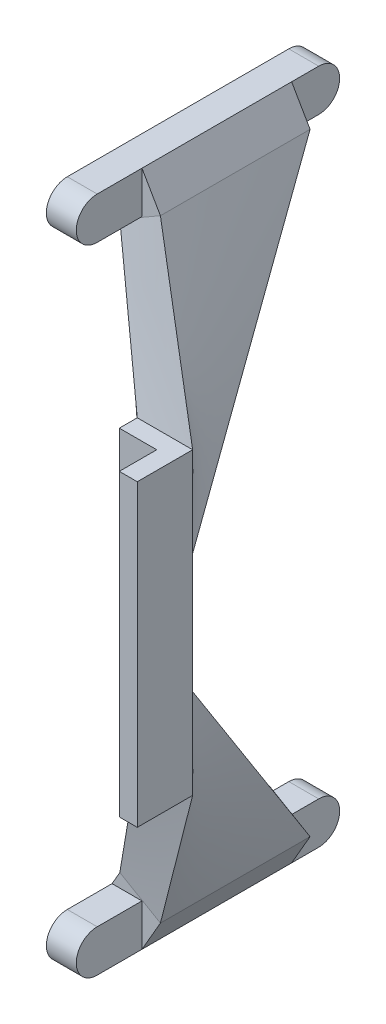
ISO-10303-21;
HEADER;
FILE_DESCRIPTION(('STEP AP214'),'2;1');
FILE_NAME('part.step','',(''),(''),'','','');
FILE_SCHEMA(('AUTOMOTIVE_DESIGN { 1 0 10303 214 1 1 1 1 }'));
ENDSEC;
DATA;
#1=APPLICATION_CONTEXT('core data for automotive mechanical design processes');
#2=APPLICATION_PROTOCOL_DEFINITION('international standard','automotive_design',2000,#1);
#3=PRODUCT_CONTEXT('',#1,'mechanical');
#4=PRODUCT('Part','Part','',(#3));
#5=PRODUCT_RELATED_PRODUCT_CATEGORY('part','',(#4));
#6=PRODUCT_DEFINITION_FORMATION('','',#4);
#7=PRODUCT_DEFINITION_CONTEXT('part definition',#1,'design');
#8=PRODUCT_DEFINITION('design','',#6,#7);
#9=PRODUCT_DEFINITION_SHAPE('','',#8);
#10=(LENGTH_UNIT() NAMED_UNIT(*) SI_UNIT(.MILLI.,.METRE.));
#11=(NAMED_UNIT(*) PLANE_ANGLE_UNIT() SI_UNIT($,.RADIAN.));
#12=(NAMED_UNIT(*) SI_UNIT($,.STERADIAN.) SOLID_ANGLE_UNIT());
#13=UNCERTAINTY_MEASURE_WITH_UNIT(LENGTH_MEASURE(1.E-05),#10,'distance_accuracy_value','');
#14=(GEOMETRIC_REPRESENTATION_CONTEXT(3) GLOBAL_UNCERTAINTY_ASSIGNED_CONTEXT((#13)) GLOBAL_UNIT_ASSIGNED_CONTEXT((#10,
#11,#12)) REPRESENTATION_CONTEXT('',''));
#15=CARTESIAN_POINT('',(0.,0.,0.));
#16=DIRECTION('',(0.,0.,1.));
#17=DIRECTION('',(1.,0.,0.));
#18=AXIS2_PLACEMENT_3D('',#15,#16,#17);
#19=CARTESIAN_POINT('',(-13.2905499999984,-70.5074559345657,-0.666749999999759));
#20=DIRECTION('',(-1.,0.,0.));
#21=DIRECTION('',(0.,0.,1.));
#22=AXIS2_PLACEMENT_3D('',#19,#20,#21);
#23=CYLINDRICAL_SURFACE('',#22,4.445);
#24=CARTESIAN_POINT('',(-19.6405499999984,-70.5074559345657,-0.666749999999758));
#25=DIRECTION('',(1.,0.,0.));
#26=DIRECTION('',(0.,0.,-1.));
#27=AXIS2_PLACEMENT_3D('',#24,#25,#26);
#28=CIRCLE('',#27,4.445);
#29=CARTESIAN_POINT('',(-19.6405499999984,-66.0624559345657,-0.666749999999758));
#30=VERTEX_POINT('',#29);
#31=CARTESIAN_POINT('',(-19.6405499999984,-74.9524559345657,-0.666749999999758));
#32=VERTEX_POINT('',#31);
#33=EDGE_CURVE('E146',#30,#32,#28,.T.);
#34=ORIENTED_EDGE('',*,*,#33,.T.);
#35=DIRECTION('',(-1.,0.,0.));
#36=VECTOR('',#35,1.);
#37=CARTESIAN_POINT('',(-13.2905499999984,-74.9524559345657,-0.666749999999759));
#38=LINE('',#37,#36);
#39=CARTESIAN_POINT('',(-13.2905499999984,-74.9524559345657,-0.666749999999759));
#40=VERTEX_POINT('',#39);
#41=EDGE_CURVE('E13',#40,#32,#38,.T.);
#42=ORIENTED_EDGE('',*,*,#41,.F.);
#43=CARTESIAN_POINT('',(-13.2905499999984,-70.5074559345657,-0.666749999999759));
#44=DIRECTION('',(1.,0.,0.));
#45=DIRECTION('',(0.,0.,-1.));
#46=AXIS2_PLACEMENT_3D('',#43,#44,#45);
#47=CIRCLE('',#46,4.445);
#48=CARTESIAN_POINT('',(-13.2905499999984,-66.0624559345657,-0.666749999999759));
#49=VERTEX_POINT('',#48);
#50=EDGE_CURVE('E129',#49,#40,#47,.T.);
#51=ORIENTED_EDGE('',*,*,#50,.F.);
#52=DIRECTION('',(-1.,0.,0.));
#53=VECTOR('',#52,1.);
#54=CARTESIAN_POINT('',(-13.2905499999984,-66.0624559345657,-0.666749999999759));
#55=LINE('',#54,#53);
#56=EDGE_CURVE('E142',#49,#30,#55,.T.);
#57=ORIENTED_EDGE('',*,*,#56,.T.);
#58=EDGE_LOOP('',(#34,#42,#51,#57));
#59=FACE_BOUND('',#58,.T.);
#60=ADVANCED_FACE('F71',(#59),#23,.T.);
#61=CARTESIAN_POINT('',(-13.2905499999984,-74.9524559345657,-0.666749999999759));
#62=DIRECTION('',(0.,1.,0.));
#63=DIRECTION('',(0.,0.,1.));
#64=AXIS2_PLACEMENT_3D('',#61,#62,#63);
#65=PLANE('',#64);
#66=DIRECTION('',(0.,0.,-1.));
#67=VECTOR('',#66,1.);
#68=CARTESIAN_POINT('',(-19.6405499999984,-74.9524559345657,-0.666749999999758));
#69=LINE('',#68,#67);
#70=CARTESIAN_POINT('',(-19.6405499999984,-74.9524559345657,-47.6567499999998));
#71=VERTEX_POINT('',#70);
#72=EDGE_CURVE('E134',#32,#71,#69,.T.);
#73=ORIENTED_EDGE('',*,*,#72,.T.);
#74=DIRECTION('',(-1.,0.,0.));
#75=VECTOR('',#74,1.);
#76=CARTESIAN_POINT('',(-13.2905499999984,-74.9524559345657,-47.6567499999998));
#77=LINE('',#76,#75);
#78=CARTESIAN_POINT('',(-13.2905499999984,-74.9524559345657,-47.6567499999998));
#79=VERTEX_POINT('',#78);
#80=EDGE_CURVE('E80',#79,#71,#77,.T.);
#81=ORIENTED_EDGE('',*,*,#80,.F.);
#82=DIRECTION('',(0.,0.,-1.));
#83=VECTOR('',#82,1.);
#84=CARTESIAN_POINT('',(-13.2905499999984,-74.9524559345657,-0.666749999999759));
#85=LINE('',#84,#83);
#86=EDGE_CURVE('E123',#40,#79,#85,.T.);
#87=ORIENTED_EDGE('',*,*,#86,.F.);
#88=ORIENTED_EDGE('',*,*,#41,.T.);
#89=EDGE_LOOP('',(#73,#81,#87,#88));
#90=FACE_BOUND('',#89,.T.);
#91=ADVANCED_FACE('F133',(#90),#65,.F.);
#92=CARTESIAN_POINT('',(-13.2905499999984,-70.5074559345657,-47.6567499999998));
#93=DIRECTION('',(-1.,0.,0.));
#94=DIRECTION('',(0.,0.,1.));
#95=AXIS2_PLACEMENT_3D('',#92,#93,#94);
#96=CYLINDRICAL_SURFACE('',#95,4.44500000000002);
#97=CARTESIAN_POINT('',(-19.6405499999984,-70.5074559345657,-47.6567499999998));
#98=DIRECTION('',(1.,0.,0.));
#99=DIRECTION('',(0.,0.,-1.));
#100=AXIS2_PLACEMENT_3D('',#97,#98,#99);
#101=CIRCLE('',#100,4.44500000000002);
#102=CARTESIAN_POINT('',(-19.6405499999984,-66.0624559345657,-47.6567499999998));
#103=VERTEX_POINT('',#102);
#104=EDGE_CURVE('E110',#71,#103,#101,.T.);
#105=ORIENTED_EDGE('',*,*,#104,.T.);
#106=DIRECTION('',(-1.,0.,0.));
#107=VECTOR('',#106,1.);
#108=CARTESIAN_POINT('',(-13.2905499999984,-66.0624559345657,-47.6567499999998));
#109=LINE('',#108,#107);
#110=CARTESIAN_POINT('',(-13.2905499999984,-66.0624559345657,-47.6567499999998));
#111=VERTEX_POINT('',#110);
#112=EDGE_CURVE('E136',#111,#103,#109,.T.);
#113=ORIENTED_EDGE('',*,*,#112,.F.);
#114=CARTESIAN_POINT('',(-13.2905499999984,-70.5074559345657,-47.6567499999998));
#115=DIRECTION('',(1.,0.,0.));
#116=DIRECTION('',(0.,0.,-1.));
#117=AXIS2_PLACEMENT_3D('',#114,#115,#116);
#118=CIRCLE('',#117,4.44500000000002);
#119=EDGE_CURVE('E127',#79,#111,#118,.T.);
#120=ORIENTED_EDGE('',*,*,#119,.F.);
#121=ORIENTED_EDGE('',*,*,#80,.T.);
#122=EDGE_LOOP('',(#105,#113,#120,#121));
#123=FACE_BOUND('',#122,.T.);
#124=ADVANCED_FACE('F137',(#123),#96,.T.);
#125=CARTESIAN_POINT('',(-13.2905499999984,-66.0624559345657,-0.666749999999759));
#126=DIRECTION('',(0.,-1.,0.));
#127=DIRECTION('',(0.,0.,-1.));
#128=AXIS2_PLACEMENT_3D('',#125,#126,#127);
#129=PLANE('',#128);
#130=DIRECTION('',(0.,0.,1.));
#131=VECTOR('',#130,1.);
#132=CARTESIAN_POINT('',(-19.6405499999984,-66.0624559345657,-0.666749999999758));
#133=LINE('',#132,#131);
#134=EDGE_CURVE('E116',#103,#30,#133,.T.);
#135=ORIENTED_EDGE('',*,*,#134,.T.);
#136=ORIENTED_EDGE('',*,*,#56,.F.);
#137=DIRECTION('',(0.,0.,1.));
#138=VECTOR('',#137,1.);
#139=CARTESIAN_POINT('',(-13.2905499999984,-66.0624559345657,-0.666749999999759));
#140=LINE('',#139,#138);
#141=EDGE_CURVE('E91',#111,#49,#140,.T.);
#142=ORIENTED_EDGE('',*,*,#141,.F.);
#143=ORIENTED_EDGE('',*,*,#112,.T.);
#144=EDGE_LOOP('',(#135,#136,#142,#143));
#145=FACE_BOUND('',#144,.T.);
#146=ADVANCED_FACE('F158',(#145),#129,.F.);
#147=CARTESIAN_POINT('',(-13.2905499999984,-70.5074559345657,-0.666749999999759));
#148=DIRECTION('',(1.,0.,0.));
#149=DIRECTION('',(0.,0.,-1.));
#150=AXIS2_PLACEMENT_3D('',#147,#148,#149);
#151=PLANE('',#150);
#152=ORIENTED_EDGE('',*,*,#50,.T.);
#153=ORIENTED_EDGE('',*,*,#86,.T.);
#154=ORIENTED_EDGE('',*,*,#119,.T.);
#155=ORIENTED_EDGE('',*,*,#141,.T.);
#156=EDGE_LOOP('',(#152,#153,#154,#155));
#157=FACE_BOUND('',#156,.T.);
#158=ADVANCED_FACE('F125',(#157),#151,.T.);
#159=CARTESIAN_POINT('',(-19.6405499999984,-70.5074559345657,-0.666749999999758));
#160=DIRECTION('',(1.,0.,0.));
#161=DIRECTION('',(0.,0.,-1.));
#162=AXIS2_PLACEMENT_3D('',#159,#160,#161);
#163=PLANE('',#162);
#164=ORIENTED_EDGE('',*,*,#33,.F.);
#165=ORIENTED_EDGE('',*,*,#134,.F.);
#166=ORIENTED_EDGE('',*,*,#104,.F.);
#167=ORIENTED_EDGE('',*,*,#72,.F.);
#168=EDGE_LOOP('',(#164,#165,#166,#167));
#169=FACE_BOUND('',#168,.T.);
#170=ADVANCED_FACE('F161',(#169),#163,.F.);
#171=CLOSED_SHELL('',(#60,#91,#124,#146,#158,#170));
#172=MANIFOLD_SOLID_BREP('B2',#171);
#173=CARTESIAN_POINT('',(3.81,-34.9474559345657,-3.80999999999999));
#174=DIRECTION('',(0.,0.,-1.));
#175=DIRECTION('',(0.,1.,0.));
#176=AXIS2_PLACEMENT_3D('',#173,#174,#175);
#177=PLANE('',#176);
#178=DIRECTION('',(1.,0.,0.));
#179=VECTOR('',#178,1.);
#180=CARTESIAN_POINT('',(-7.9375,-15.8974559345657,-3.81));
#181=LINE('',#180,#179);
#182=CARTESIAN_POINT('',(-7.9375,-15.8974559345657,-3.80999999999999));
#183=VERTEX_POINT('',#182);
#184=CARTESIAN_POINT('',(3.81,-15.8974559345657,-3.81));
#185=VERTEX_POINT('',#184);
#186=EDGE_CURVE('E240',#183,#185,#181,.T.);
#187=ORIENTED_EDGE('',*,*,#186,.F.);
#188=DIRECTION('',(0.,1.,0.));
#189=VECTOR('',#188,1.);
#190=CARTESIAN_POINT('',(-7.9375,-34.9474559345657,-3.80999999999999));
#191=LINE('',#190,#189);
#192=CARTESIAN_POINT('',(-7.9375,9.50254406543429,-3.81));
#193=VERTEX_POINT('',#192);
#194=EDGE_CURVE('E617',#183,#193,#191,.T.);
#195=ORIENTED_EDGE('',*,*,#194,.T.);
#196=DIRECTION('',(1.,0.,0.));
#197=VECTOR('',#196,1.);
#198=CARTESIAN_POINT('',(-7.9375,9.50254406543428,-3.81));
#199=LINE('',#198,#197);
#200=CARTESIAN_POINT('',(3.81,9.50254406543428,-3.81));
#201=VERTEX_POINT('',#200);
#202=EDGE_CURVE('E663',#193,#201,#199,.T.);
#203=ORIENTED_EDGE('',*,*,#202,.T.);
#204=DIRECTION('',(0.,1.,0.));
#205=VECTOR('',#204,1.);
#206=CARTESIAN_POINT('',(3.81,-34.9474559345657,-3.80999999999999));
#207=LINE('',#206,#205);
#208=EDGE_CURVE('E246',#185,#201,#207,.T.);
#209=ORIENTED_EDGE('',*,*,#208,.F.);
#210=EDGE_LOOP('',(#187,#195,#203,#209));
#211=FACE_BOUND('',#210,.T.);
#212=ADVANCED_FACE('F218',(#211),#177,.T.);
#213=CARTESIAN_POINT('',(0.,-34.9474559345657,0.));
#214=DIRECTION('',(-1.,0.,0.));
#215=DIRECTION('',(0.,0.,1.));
#216=AXIS2_PLACEMENT_3D('',#213,#214,#215);
#217=PLANE('',#216);
#218=DIRECTION('',(0.,0.,1.));
#219=VECTOR('',#218,1.);
#220=CARTESIAN_POINT('',(0.,28.5525440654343,0.));
#221=LINE('',#220,#219);
#222=CARTESIAN_POINT('',(0.,28.5525440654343,0.));
#223=VERTEX_POINT('',#222);
#224=CARTESIAN_POINT('',(0.,28.5525440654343,7.93749999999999));
#225=VERTEX_POINT('',#224);
#226=EDGE_CURVE('E674',#223,#225,#221,.T.);
#227=ORIENTED_EDGE('',*,*,#226,.F.);
#228=DIRECTION('',(0.,1.,0.));
#229=VECTOR('',#228,1.);
#230=CARTESIAN_POINT('',(0.,-34.9474559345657,0.));
#231=LINE('',#230,#229);
#232=CARTESIAN_POINT('',(0.,-34.9474559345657,0.));
#233=VERTEX_POINT('',#232);
#234=EDGE_CURVE('E69',#233,#223,#231,.T.);
#235=ORIENTED_EDGE('',*,*,#234,.F.);
#236=DIRECTION('',(0.,0.,1.));
#237=VECTOR('',#236,1.);
#238=CARTESIAN_POINT('',(0.,-34.9474559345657,0.));
#239=LINE('',#238,#237);
#240=CARTESIAN_POINT('',(0.,-34.9474559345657,7.93750000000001));
#241=VERTEX_POINT('',#240);
#242=EDGE_CURVE('E715',#233,#241,#239,.T.);
#243=ORIENTED_EDGE('',*,*,#242,.T.);
#244=DIRECTION('',(0.,1.,0.));
#245=VECTOR('',#244,1.);
#246=CARTESIAN_POINT('',(0.,-34.9474559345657,7.93750000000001));
#247=LINE('',#246,#245);
#248=EDGE_CURVE('E636',#241,#225,#247,.T.);
#249=ORIENTED_EDGE('',*,*,#248,.T.);
#250=EDGE_LOOP('',(#227,#235,#243,#249));
#251=FACE_BOUND('',#250,.T.);
#252=ADVANCED_FACE('F220',(#251),#217,.T.);
#253=CARTESIAN_POINT('',(0.,-34.9474559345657,0.));
#254=DIRECTION('',(0.,0.,1.));
#255=DIRECTION('',(0.,-1.,0.));
#256=AXIS2_PLACEMENT_3D('',#253,#254,#255);
#257=PLANE('',#256);
#258=DIRECTION('',(1.,0.,0.));
#259=VECTOR('',#258,1.);
#260=CARTESIAN_POINT('',(0.,28.5525440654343,0.));
#261=LINE('',#260,#259);
#262=CARTESIAN_POINT('',(-7.9375,28.5525440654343,0.));
#263=VERTEX_POINT('',#262);
#264=EDGE_CURVE('E644',#263,#223,#261,.T.);
#265=ORIENTED_EDGE('',*,*,#264,.F.);
#266=DIRECTION('',(0.,1.,0.));
#267=VECTOR('',#266,1.);
#268=CARTESIAN_POINT('',(-7.9375,-34.9474559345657,0.));
#269=LINE('',#268,#267);
#270=CARTESIAN_POINT('',(-7.9375,-34.9474559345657,0.));
#271=VERTEX_POINT('',#270);
#272=EDGE_CURVE('E229',#271,#263,#269,.T.);
#273=ORIENTED_EDGE('',*,*,#272,.F.);
#274=DIRECTION('',(1.,0.,0.));
#275=VECTOR('',#274,1.);
#276=CARTESIAN_POINT('',(0.,-34.9474559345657,0.));
#277=LINE('',#276,#275);
#278=EDGE_CURVE('E639',#271,#233,#277,.T.);
#279=ORIENTED_EDGE('',*,*,#278,.T.);
#280=ORIENTED_EDGE('',*,*,#234,.T.);
#281=EDGE_LOOP('',(#265,#273,#279,#280));
#282=FACE_BOUND('',#281,.T.);
#283=ADVANCED_FACE('F741',(#282),#257,.T.);
#284=CARTESIAN_POINT('',(-7.9375,-34.9474559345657,-3.80999999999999));
#285=DIRECTION('',(-1.,0.,0.));
#286=DIRECTION('',(0.,-1.,0.));
#287=AXIS2_PLACEMENT_3D('',#284,#285,#286);
#288=PLANE('',#287);
#289=DIRECTION('',(0.,0.,1.));
#290=VECTOR('',#289,1.);
#291=CARTESIAN_POINT('',(-7.9375,28.5525440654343,-3.81000000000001));
#292=LINE('',#291,#290);
#293=CARTESIAN_POINT('',(-7.9375,28.5525440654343,-3.81));
#294=VERTEX_POINT('',#293);
#295=EDGE_CURVE('E640',#294,#263,#292,.T.);
#296=ORIENTED_EDGE('',*,*,#295,.F.);
#297=DIRECTION('',(0.,-1.,0.));
#298=VECTOR('',#297,1.);
#299=CARTESIAN_POINT('',(-7.9375,28.5525440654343,-3.81));
#300=LINE('',#299,#298);
#301=EDGE_CURVE('E659',#294,#193,#300,.T.);
#302=ORIENTED_EDGE('',*,*,#301,.T.);
#303=ORIENTED_EDGE('',*,*,#194,.F.);
#304=CARTESIAN_POINT('',(-7.9375,-34.9474559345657,-3.81));
#305=CARTESIAN_POINT('',(-7.9375,-31.7724559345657,-3.81));
#306=CARTESIAN_POINT('',(-7.9375,-28.5974559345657,-3.81));
#307=CARTESIAN_POINT('',(-7.9375,-22.2474559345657,-3.81));
#308=CARTESIAN_POINT('',(-7.9375,-19.0724559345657,-3.81));
#309=CARTESIAN_POINT('',(-7.9375,-15.8974559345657,-3.81));
#310=B_SPLINE_CURVE_WITH_KNOTS('',3,(#304,#305,#306,#307,#308,#309),.UNSPECIFIED.,.F.,.F.,(4,2,
4),(0.,0.5,1.),.UNSPECIFIED.);
#311=CARTESIAN_POINT('',(-7.9375,-34.9474559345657,-3.81));
#312=VERTEX_POINT('',#311);
#313=EDGE_CURVE('E604',#312,#183,#310,.T.);
#314=ORIENTED_EDGE('',*,*,#313,.F.);
#315=DIRECTION('',(0.,0.,1.));
#316=VECTOR('',#315,1.);
#317=CARTESIAN_POINT('',(-7.9375,-34.9474559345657,-3.80999999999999));
#318=LINE('',#317,#316);
#319=EDGE_CURVE('E727',#312,#271,#318,.T.);
#320=ORIENTED_EDGE('',*,*,#319,.T.);
#321=ORIENTED_EDGE('',*,*,#272,.T.);
#322=EDGE_LOOP('',(#296,#302,#303,#314,#320,#321));
#323=FACE_BOUND('',#322,.T.);
#324=ADVANCED_FACE('F779',(#323),#288,.T.);
#325=CARTESIAN_POINT('',(3.81,-34.9474559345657,7.93750000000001));
#326=DIRECTION('',(1.,0.,0.));
#327=DIRECTION('',(0.,1.,0.));
#328=AXIS2_PLACEMENT_3D('',#325,#326,#327);
#329=PLANE('',#328);
#330=DIRECTION('',(0.,0.,-1.));
#331=VECTOR('',#330,1.);
#332=CARTESIAN_POINT('',(3.81,28.5525440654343,7.93749999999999));
#333=LINE('',#332,#331);
#334=CARTESIAN_POINT('',(3.81,28.5525440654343,7.93749999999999));
#335=VERTEX_POINT('',#334);
#336=CARTESIAN_POINT('',(3.81,28.5525440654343,-3.81));
#337=VERTEX_POINT('',#336);
#338=EDGE_CURVE('E648',#335,#337,#333,.T.);
#339=ORIENTED_EDGE('',*,*,#338,.F.);
#340=DIRECTION('',(0.,1.,0.));
#341=VECTOR('',#340,1.);
#342=CARTESIAN_POINT('',(3.81,-34.9474559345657,7.93750000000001));
#343=LINE('',#342,#341);
#344=CARTESIAN_POINT('',(3.81,-34.9474559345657,7.93750000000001));
#345=VERTEX_POINT('',#344);
#346=EDGE_CURVE('E633',#345,#335,#343,.T.);
#347=ORIENTED_EDGE('',*,*,#346,.F.);
#348=DIRECTION('',(0.,0.,-1.));
#349=VECTOR('',#348,1.);
#350=CARTESIAN_POINT('',(3.81,-34.9474559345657,7.93750000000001));
#351=LINE('',#350,#349);
#352=CARTESIAN_POINT('',(3.81,-34.9474559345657,-3.80999999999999));
#353=VERTEX_POINT('',#352);
#354=EDGE_CURVE('E723',#345,#353,#351,.T.);
#355=ORIENTED_EDGE('',*,*,#354,.T.);
#356=CARTESIAN_POINT('',(3.81,-15.8974559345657,-3.81));
#357=CARTESIAN_POINT('',(3.81,-19.0724559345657,-3.81));
#358=CARTESIAN_POINT('',(3.81,-22.2474559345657,-3.81));
#359=CARTESIAN_POINT('',(3.81,-28.5974559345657,-3.81));
#360=CARTESIAN_POINT('',(3.81,-31.7724559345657,-3.81));
#361=CARTESIAN_POINT('',(3.81,-34.9474559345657,-3.81));
#362=B_SPLINE_CURVE_WITH_KNOTS('',3,(#356,#357,#358,#359,#360,#361),.UNSPECIFIED.,.F.,.F.,(4,2,
4),(0.,0.5,1.),.UNSPECIFIED.);
#363=EDGE_CURVE('E507',#353,#185,#362,.F.);
#364=ORIENTED_EDGE('',*,*,#363,.T.);
#365=ORIENTED_EDGE('',*,*,#208,.T.);
#366=DIRECTION('',(0.,1.,0.));
#367=VECTOR('',#366,1.);
#368=CARTESIAN_POINT('',(3.81,28.5525440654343,-3.81));
#369=LINE('',#368,#367);
#370=EDGE_CURVE('E669',#201,#337,#369,.T.);
#371=ORIENTED_EDGE('',*,*,#370,.T.);
#372=EDGE_LOOP('',(#339,#347,#355,#364,#365,#371));
#373=FACE_BOUND('',#372,.T.);
#374=ADVANCED_FACE('F752',(#373),#329,.T.);
#375=CARTESIAN_POINT('',(0.,-34.9474559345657,7.93750000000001));
#376=DIRECTION('',(0.,0.,1.));
#377=DIRECTION('',(0.,-1.,0.));
#378=AXIS2_PLACEMENT_3D('',#375,#376,#377);
#379=PLANE('',#378);
#380=DIRECTION('',(1.,0.,0.));
#381=VECTOR('',#380,1.);
#382=CARTESIAN_POINT('',(0.,28.5525440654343,7.93749999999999));
#383=LINE('',#382,#381);
#384=EDGE_CURVE('E651',#225,#335,#383,.T.);
#385=ORIENTED_EDGE('',*,*,#384,.F.);
#386=ORIENTED_EDGE('',*,*,#248,.F.);
#387=DIRECTION('',(1.,0.,0.));
#388=VECTOR('',#387,1.);
#389=CARTESIAN_POINT('',(0.,-34.9474559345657,7.93750000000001));
#390=LINE('',#389,#388);
#391=EDGE_CURVE('E719',#241,#345,#390,.T.);
#392=ORIENTED_EDGE('',*,*,#391,.T.);
#393=ORIENTED_EDGE('',*,*,#346,.T.);
#394=EDGE_LOOP('',(#385,#386,#392,#393));
#395=FACE_BOUND('',#394,.T.);
#396=ADVANCED_FACE('F748',(#395),#379,.T.);
#397=CARTESIAN_POINT('',(0.,-34.9474559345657,0.));
#398=DIRECTION('',(0.,1.,0.));
#399=DIRECTION('',(0.,0.,1.));
#400=AXIS2_PLACEMENT_3D('',#397,#398,#399);
#401=PLANE('',#400);
#402=ORIENTED_EDGE('',*,*,#242,.F.);
#403=ORIENTED_EDGE('',*,*,#278,.F.);
#404=ORIENTED_EDGE('',*,*,#319,.F.);
#405=DIRECTION('',(1.,0.,0.));
#406=VECTOR('',#405,1.);
#407=CARTESIAN_POINT('',(0.,-34.9474559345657,-3.80999999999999));
#408=LINE('',#407,#406);
#409=EDGE_CURVE('E782',#353,#312,#408,.F.);
#410=ORIENTED_EDGE('',*,*,#409,.F.);
#411=ORIENTED_EDGE('',*,*,#354,.F.);
#412=ORIENTED_EDGE('',*,*,#391,.F.);
#413=EDGE_LOOP('',(#402,#403,#404,#410,#411,#412));
#414=FACE_BOUND('',#413,.T.);
#415=ADVANCED_FACE('F784',(#414),#401,.F.);
#416=CARTESIAN_POINT('',(0.,28.5525440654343,0.));
#417=DIRECTION('',(0.,1.,0.));
#418=DIRECTION('',(0.,0.,1.));
#419=AXIS2_PLACEMENT_3D('',#416,#417,#418);
#420=PLANE('',#419);
#421=ORIENTED_EDGE('',*,*,#226,.T.);
#422=ORIENTED_EDGE('',*,*,#384,.T.);
#423=ORIENTED_EDGE('',*,*,#338,.T.);
#424=DIRECTION('',(1.,0.,0.));
#425=VECTOR('',#424,1.);
#426=CARTESIAN_POINT('',(0.,28.5525440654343,-3.81000000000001));
#427=LINE('',#426,#425);
#428=EDGE_CURVE('E645',#337,#294,#427,.F.);
#429=ORIENTED_EDGE('',*,*,#428,.T.);
#430=ORIENTED_EDGE('',*,*,#295,.T.);
#431=ORIENTED_EDGE('',*,*,#264,.T.);
#432=EDGE_LOOP('',(#421,#422,#423,#429,#430,#431));
#433=FACE_BOUND('',#432,.T.);
#434=ADVANCED_FACE('F737',(#433),#420,.T.);
#435=CARTESIAN_POINT('',(-9.37756708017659,61.7800588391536,-10.16));
#436=CARTESIAN_POINT('',(3.81,28.5525440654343,-3.81));
#437=CARTESIAN_POINT('',(-10.8128975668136,60.9513703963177,-10.16));
#438=CARTESIAN_POINT('',(1.85208333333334,28.5525440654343,-3.81));
#439=CARTESIAN_POINT('',(-12.2482280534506,60.1226819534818,-10.16));
#440=CARTESIAN_POINT('',(-0.105833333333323,28.5525440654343,-3.81));
#441=CARTESIAN_POINT('',(-15.1188890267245,58.4653050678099,-10.16));
#442=CARTESIAN_POINT('',(-4.02166666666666,28.5525440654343,-3.81));
#443=CARTESIAN_POINT('',(-16.5542195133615,57.636616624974,-10.16));
#444=CARTESIAN_POINT('',(-5.97958333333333,28.5525440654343,-3.81));
#445=CARTESIAN_POINT('',(-17.9895499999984,56.8079281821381,-10.16));
#446=CARTESIAN_POINT('',(-7.9375,28.5525440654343,-3.81));
#447=B_SPLINE_SURFACE_WITH_KNOTS('',3,1,((#435,#436),(#437,#438),(#439,#440),(#441,#442),(#443,
#444),(#445,#446)),.UNSPECIFIED.,.F.,.F.,.F.,(4,2,4),(2,2),(0.,0.5,1.),(0.,1.),.UNSPECIFIED.);
#448=DIRECTION('',(-0.866025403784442,-0.499999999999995,0.));
#449=VECTOR('',#448,1.);
#450=CARTESIAN_POINT('',(-9.37756708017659,61.7800588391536,-10.16));
#451=LINE('',#450,#449);
#452=CARTESIAN_POINT('',(-9.37756708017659,61.7800588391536,-10.16));
#453=VERTEX_POINT('',#452);
#454=CARTESIAN_POINT('',(-17.9895499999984,56.8079281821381,-10.16));
#455=VERTEX_POINT('',#454);
#456=EDGE_CURVE('E689',#453,#455,#451,.T.);
#457=DIRECTION('',(0.32790830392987,-0.921719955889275,0.207143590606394));
#458=VECTOR('',#457,1.);
#459=CARTESIAN_POINT('',(-12.9635249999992,42.6802361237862,-6.985));
#460=LINE('',#459,#458);
#461=EDGE_CURVE('E777',#455,#294,#460,.T.);
#462=DIRECTION('',(-0.363209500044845,0.915145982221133,-0.174890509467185));
#463=VECTOR('',#462,1.);
#464=CARTESIAN_POINT('',(-2.78378354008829,45.166301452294,-6.985));
#465=LINE('',#464,#463);
#466=EDGE_CURVE('E763',#337,#453,#465,.T.);
#467=ORIENTED_EDGE('',*,*,#456,.T.);
#468=ORIENTED_EDGE('',*,*,#461,.T.);
#469=ORIENTED_EDGE('',*,*,#428,.F.);
#470=ORIENTED_EDGE('',*,*,#466,.T.);
#471=EDGE_LOOP('',(#467,#468,#469,#470));
#472=FACE_BOUND('',#471,.T.);
#473=ADVANCED_FACE('F1000',(#472),#447,.T.);
#474=CARTESIAN_POINT('',(-17.9895499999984,56.8079281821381,-10.16));
#475=CARTESIAN_POINT('',(-7.9375,28.5525440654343,-3.81));
#476=CARTESIAN_POINT('',(-17.9895499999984,56.8079281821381,-15.4516666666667));
#477=CARTESIAN_POINT('',(-7.9375,25.3775440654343,-3.81));
#478=CARTESIAN_POINT('',(-17.9895499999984,56.8079281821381,-20.7433333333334));
#479=CARTESIAN_POINT('',(-7.9375,22.2025440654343,-3.81));
#480=CARTESIAN_POINT('',(-17.9895499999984,56.8079281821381,-31.3266666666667));
#481=CARTESIAN_POINT('',(-7.9375,15.8525440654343,-3.81));
#482=CARTESIAN_POINT('',(-17.9895499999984,56.8079281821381,-36.6183333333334));
#483=CARTESIAN_POINT('',(-7.9375,12.6775440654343,-3.81));
#484=CARTESIAN_POINT('',(-17.9895499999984,56.8079281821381,-41.91));
#485=CARTESIAN_POINT('',(-7.9375,9.50254406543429,-3.81));
#486=B_SPLINE_SURFACE_WITH_KNOTS('',3,1,((#474,#475),(#476,#477),(#478,#479),(#480,#481),(#482,
#483),(#484,#485)),.UNSPECIFIED.,.F.,.F.,.F.,(4,2,4),(2,2),(0.,0.5,1.),(0.,1.),.UNSPECIFIED.);
#487=DIRECTION('',(0.,0.,-1.));
#488=VECTOR('',#487,1.);
#489=CARTESIAN_POINT('',(-17.9895499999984,56.8079281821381,-41.91));
#490=LINE('',#489,#488);
#491=CARTESIAN_POINT('',(-17.9895499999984,56.8079281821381,-41.91));
#492=VERTEX_POINT('',#491);
#493=EDGE_CURVE('E707',#455,#492,#490,.T.);
#494=DIRECTION('',(0.163271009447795,-0.768360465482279,0.618841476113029));
#495=VECTOR('',#494,1.);
#496=CARTESIAN_POINT('',(-12.9635249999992,33.1552361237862,-22.86));
#497=LINE('',#496,#495);
#498=EDGE_CURVE('E768',#492,#193,#497,.T.);
#499=ORIENTED_EDGE('',*,*,#493,.T.);
#500=ORIENTED_EDGE('',*,*,#498,.T.);
#501=ORIENTED_EDGE('',*,*,#301,.F.);
#502=ORIENTED_EDGE('',*,*,#461,.F.);
#503=EDGE_LOOP('',(#499,#500,#501,#502));
#504=FACE_BOUND('',#503,.T.);
#505=ADVANCED_FACE('F771',(#504),#486,.T.);
#506=CARTESIAN_POINT('',(-9.37756708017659,61.7800588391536,-41.91));
#507=CARTESIAN_POINT('',(3.81,9.50254406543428,-3.81));
#508=CARTESIAN_POINT('',(-9.37756708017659,61.7800588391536,-36.6183333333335));
#509=CARTESIAN_POINT('',(3.81,12.6775440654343,-3.81));
#510=CARTESIAN_POINT('',(-9.37756708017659,61.7800588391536,-31.3266666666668));
#511=CARTESIAN_POINT('',(3.81,15.8525440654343,-3.81));
#512=CARTESIAN_POINT('',(-9.37756708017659,61.7800588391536,-20.7433333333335));
#513=CARTESIAN_POINT('',(3.81,22.2025440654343,-3.81));
#514=CARTESIAN_POINT('',(-9.37756708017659,61.7800588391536,-15.4516666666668));
#515=CARTESIAN_POINT('',(3.81,25.3775440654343,-3.81));
#516=CARTESIAN_POINT('',(-9.37756708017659,61.7800588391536,-10.16));
#517=CARTESIAN_POINT('',(3.81,28.5525440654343,-3.81));
#518=B_SPLINE_SURFACE_WITH_KNOTS('',3,1,((#506,#507),(#508,#509),(#510,#511),(#512,#513),(#514,
#515),(#516,#517)),.UNSPECIFIED.,.F.,.F.,.F.,(4,2,4),(2,2),(0.,0.5,1.),(0.,1.),.UNSPECIFIED.);
#519=DIRECTION('',(0.,0.,1.));
#520=VECTOR('',#519,1.);
#521=CARTESIAN_POINT('',(-9.37756708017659,61.7800588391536,-41.91));
#522=LINE('',#521,#520);
#523=CARTESIAN_POINT('',(-9.3775670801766,61.7800588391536,-41.91));
#524=VERTEX_POINT('',#523);
#525=EDGE_CURVE('E708',#524,#453,#522,.T.);
#526=DIRECTION('',(0.19975521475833,-0.791859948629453,0.577109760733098));
#527=VECTOR('',#526,1.);
#528=CARTESIAN_POINT('',(-2.78378354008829,35.641301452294,-22.86));
#529=LINE('',#528,#527);
#530=EDGE_CURVE('E664',#524,#201,#529,.T.);
#531=ORIENTED_EDGE('',*,*,#525,.T.);
#532=ORIENTED_EDGE('',*,*,#466,.F.);
#533=ORIENTED_EDGE('',*,*,#370,.F.);
#534=ORIENTED_EDGE('',*,*,#530,.F.);
#535=EDGE_LOOP('',(#531,#532,#533,#534));
#536=FACE_BOUND('',#535,.T.);
#537=ADVANCED_FACE('F760',(#536),#518,.T.);
#538=CARTESIAN_POINT('',(-17.9895499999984,56.8079281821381,-41.91));
#539=CARTESIAN_POINT('',(-7.9375,9.50254406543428,-3.81));
#540=CARTESIAN_POINT('',(-16.5542195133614,57.636616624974,-41.91));
#541=CARTESIAN_POINT('',(-5.97958333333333,9.50254406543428,-3.81));
#542=CARTESIAN_POINT('',(-15.1188890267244,58.46530506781,-41.91));
#543=CARTESIAN_POINT('',(-4.02166666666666,9.50254406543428,-3.81));
#544=CARTESIAN_POINT('',(-12.2482280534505,60.1226819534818,-41.91));
#545=CARTESIAN_POINT('',(-0.105833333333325,9.50254406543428,-3.81));
#546=CARTESIAN_POINT('',(-10.8128975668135,60.9513703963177,-41.91));
#547=CARTESIAN_POINT('',(1.85208333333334,9.50254406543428,-3.81));
#548=CARTESIAN_POINT('',(-9.37756708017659,61.7800588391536,-41.91));
#549=CARTESIAN_POINT('',(3.81,9.50254406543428,-3.81));
#550=B_SPLINE_SURFACE_WITH_KNOTS('',3,1,((#538,#539),(#540,#541),(#542,#543),(#544,#545),(#546,
#547),(#548,#549)),.UNSPECIFIED.,.F.,.F.,.F.,(4,2,4),(2,2),(0.,0.5,1.),(0.,1.),.UNSPECIFIED.);
#551=DIRECTION('',(0.866025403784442,0.499999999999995,0.));
#552=VECTOR('',#551,1.);
#553=CARTESIAN_POINT('',(-9.37756708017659,61.7800588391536,-41.91));
#554=LINE('',#553,#552);
#555=EDGE_CURVE('E1175',#492,#524,#554,.T.);
#556=ORIENTED_EDGE('',*,*,#555,.T.);
#557=ORIENTED_EDGE('',*,*,#530,.T.);
#558=ORIENTED_EDGE('',*,*,#202,.F.);
#559=ORIENTED_EDGE('',*,*,#498,.F.);
#560=EDGE_LOOP('',(#556,#557,#558,#559));
#561=FACE_BOUND('',#560,.T.);
#562=ADVANCED_FACE('F767',(#561),#550,.T.);
#563=CARTESIAN_POINT('',(-13.2905499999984,59.6675440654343,-0.666749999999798));
#564=DIRECTION('',(0.,1.,0.));
#565=DIRECTION('',(0.,0.,1.));
#566=AXIS2_PLACEMENT_3D('',#563,#564,#565);
#567=PLANE('',#566);
#568=DIRECTION('',(1.,0.,0.));
#569=VECTOR('',#568,1.);
#570=CARTESIAN_POINT('',(-19.6405499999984,59.6675440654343,-10.16));
#571=LINE('',#570,#569);
#572=CARTESIAN_POINT('',(-19.6405499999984,59.6675440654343,-10.16));
#573=VERTEX_POINT('',#572);
#574=CARTESIAN_POINT('',(-13.2905499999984,59.6675440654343,-10.16));
#575=VERTEX_POINT('',#574);
#576=EDGE_CURVE('E681',#573,#575,#571,.T.);
#577=ORIENTED_EDGE('',*,*,#576,.T.);
#578=DIRECTION('',(0.,0.,-1.));
#579=VECTOR('',#578,1.);
#580=CARTESIAN_POINT('',(-13.2905499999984,59.6675440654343,-0.666749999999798));
#581=LINE('',#580,#579);
#582=CARTESIAN_POINT('',(-13.2905499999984,59.6675440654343,-0.666749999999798));
#583=VERTEX_POINT('',#582);
#584=EDGE_CURVE('E1248',#583,#575,#581,.T.);
#585=ORIENTED_EDGE('',*,*,#584,.F.);
#586=DIRECTION('',(-1.,0.,0.));
#587=VECTOR('',#586,1.);
#588=CARTESIAN_POINT('',(-13.2905499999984,59.6675440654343,-0.666749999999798));
#589=LINE('',#588,#587);
#590=CARTESIAN_POINT('',(-19.6405499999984,59.6675440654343,-0.666749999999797));
#591=VERTEX_POINT('',#590);
#592=EDGE_CURVE('E1210',#583,#591,#589,.T.);
#593=ORIENTED_EDGE('',*,*,#592,.T.);
#594=DIRECTION('',(0.,0.,-1.));
#595=VECTOR('',#594,1.);
#596=CARTESIAN_POINT('',(-19.6405499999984,59.6675440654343,-0.666749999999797));
#597=LINE('',#596,#595);
#598=EDGE_CURVE('E1264',#591,#573,#597,.T.);
#599=ORIENTED_EDGE('',*,*,#598,.T.);
#600=EDGE_LOOP('',(#577,#585,#593,#599));
#601=FACE_BOUND('',#600,.T.);
#602=ADVANCED_FACE('F970',(#601),#567,.F.);
#603=CARTESIAN_POINT('',(-13.2905499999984,64.1125440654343,-0.666749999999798));
#604=DIRECTION('',(1.,0.,0.));
#605=DIRECTION('',(0.,0.,-1.));
#606=AXIS2_PLACEMENT_3D('',#603,#604,#605);
#607=PLANE('',#606);
#608=ORIENTED_EDGE('',*,*,#584,.T.);
#609=DIRECTION('',(0.,1.,0.));
#610=VECTOR('',#609,1.);
#611=CARTESIAN_POINT('',(-13.2905499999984,59.6675440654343,-10.16));
#612=LINE('',#611,#610);
#613=CARTESIAN_POINT('',(-13.2905499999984,68.5575440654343,-10.16));
#614=VERTEX_POINT('',#613);
#615=EDGE_CURVE('E701',#575,#614,#612,.T.);
#616=ORIENTED_EDGE('',*,*,#615,.T.);
#617=DIRECTION('',(0.,0.,1.));
#618=VECTOR('',#617,1.);
#619=CARTESIAN_POINT('',(-13.2905499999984,68.5575440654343,-0.666749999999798));
#620=LINE('',#619,#618);
#621=CARTESIAN_POINT('',(-13.2905499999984,68.5575440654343,-0.666749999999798));
#622=VERTEX_POINT('',#621);
#623=EDGE_CURVE('E1254',#614,#622,#620,.T.);
#624=ORIENTED_EDGE('',*,*,#623,.T.);
#625=CARTESIAN_POINT('',(-13.2905499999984,64.1125440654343,-0.666749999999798));
#626=DIRECTION('',(1.,0.,0.));
#627=DIRECTION('',(0.,0.,-1.));
#628=AXIS2_PLACEMENT_3D('',#625,#626,#627);
#629=CIRCLE('',#628,4.445);
#630=EDGE_CURVE('E1242',#622,#583,#629,.T.);
#631=ORIENTED_EDGE('',*,*,#630,.T.);
#632=EDGE_LOOP('',(#608,#616,#624,#631));
#633=FACE_BOUND('',#632,.T.);
#634=ADVANCED_FACE('F947',(#633),#607,.T.);
#635=CARTESIAN_POINT('',(-13.2905499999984,64.1125440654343,-0.666749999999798));
#636=DIRECTION('',(-1.,0.,0.));
#637=DIRECTION('',(0.,0.,1.));
#638=AXIS2_PLACEMENT_3D('',#635,#636,#637);
#639=CYLINDRICAL_SURFACE('',#638,4.445);
#640=CARTESIAN_POINT('',(-19.6405499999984,64.1125440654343,-0.666749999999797));
#641=DIRECTION('',(1.,0.,0.));
#642=DIRECTION('',(0.,0.,-1.));
#643=AXIS2_PLACEMENT_3D('',#640,#641,#642);
#644=CIRCLE('',#643,4.445);
#645=CARTESIAN_POINT('',(-19.6405499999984,68.5575440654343,-0.666749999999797));
#646=VERTEX_POINT('',#645);
#647=EDGE_CURVE('E1238',#646,#591,#644,.T.);
#648=ORIENTED_EDGE('',*,*,#647,.T.);
#649=ORIENTED_EDGE('',*,*,#592,.F.);
#650=ORIENTED_EDGE('',*,*,#630,.F.);
#651=DIRECTION('',(-1.,0.,0.));
#652=VECTOR('',#651,1.);
#653=CARTESIAN_POINT('',(-13.2905499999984,68.5575440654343,-0.666749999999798));
#654=LINE('',#653,#652);
#655=EDGE_CURVE('E1259',#622,#646,#654,.T.);
#656=ORIENTED_EDGE('',*,*,#655,.T.);
#657=EDGE_LOOP('',(#648,#649,#650,#656));
#658=FACE_BOUND('',#657,.T.);
#659=ADVANCED_FACE('F967',(#658),#639,.T.);
#660=CARTESIAN_POINT('',(-13.2905499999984,59.6675440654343,-41.91));
#661=VERTEX_POINT('',#660);
#662=CARTESIAN_POINT('',(-13.2905499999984,59.6675440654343,-47.6567499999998));
#663=VERTEX_POINT('',#662);
#664=EDGE_CURVE('E1246',#661,#663,#581,.T.);
#665=ORIENTED_EDGE('',*,*,#664,.F.);
#666=DIRECTION('',(1.,0.,0.));
#667=VECTOR('',#666,1.);
#668=CARTESIAN_POINT('',(-19.6405499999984,59.6675440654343,-41.91));
#669=LINE('',#668,#667);
#670=CARTESIAN_POINT('',(-19.6405499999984,59.6675440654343,-41.91));
#671=VERTEX_POINT('',#670);
#672=EDGE_CURVE('E1222',#671,#661,#669,.T.);
#673=ORIENTED_EDGE('',*,*,#672,.F.);
#674=CARTESIAN_POINT('',(-19.6405499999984,59.6675440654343,-47.6567499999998));
#675=VERTEX_POINT('',#674);
#676=EDGE_CURVE('E1263',#671,#675,#597,.T.);
#677=ORIENTED_EDGE('',*,*,#676,.T.);
#678=DIRECTION('',(-1.,0.,0.));
#679=VECTOR('',#678,1.);
#680=CARTESIAN_POINT('',(-13.2905499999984,59.6675440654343,-47.6567499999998));
#681=LINE('',#680,#679);
#682=EDGE_CURVE('E1280',#663,#675,#681,.T.);
#683=ORIENTED_EDGE('',*,*,#682,.F.);
#684=EDGE_LOOP('',(#665,#673,#677,#683));
#685=FACE_BOUND('',#684,.T.);
#686=ADVANCED_FACE('F960',(#685),#567,.F.);
#687=CARTESIAN_POINT('',(-13.2905499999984,64.1125440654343,-47.6567499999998));
#688=DIRECTION('',(-1.,0.,0.));
#689=DIRECTION('',(0.,0.,1.));
#690=AXIS2_PLACEMENT_3D('',#687,#688,#689);
#691=CYLINDRICAL_SURFACE('',#690,4.44500000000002);
#692=CARTESIAN_POINT('',(-19.6405499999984,64.1125440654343,-47.6567499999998));
#693=DIRECTION('',(1.,0.,0.));
#694=DIRECTION('',(0.,0.,-1.));
#695=AXIS2_PLACEMENT_3D('',#692,#693,#694);
#696=CIRCLE('',#695,4.44500000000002);
#697=CARTESIAN_POINT('',(-19.6405499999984,68.5575440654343,-47.6567499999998));
#698=VERTEX_POINT('',#697);
#699=EDGE_CURVE('E1268',#675,#698,#696,.T.);
#700=ORIENTED_EDGE('',*,*,#699,.T.);
#701=DIRECTION('',(-1.,0.,0.));
#702=VECTOR('',#701,1.);
#703=CARTESIAN_POINT('',(-13.2905499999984,68.5575440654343,-47.6567499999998));
#704=LINE('',#703,#702);
#705=CARTESIAN_POINT('',(-13.2905499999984,68.5575440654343,-47.6567499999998));
#706=VERTEX_POINT('',#705);
#707=EDGE_CURVE('E1276',#706,#698,#704,.T.);
#708=ORIENTED_EDGE('',*,*,#707,.F.);
#709=CARTESIAN_POINT('',(-13.2905499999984,64.1125440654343,-47.6567499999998));
#710=DIRECTION('',(1.,0.,0.));
#711=DIRECTION('',(0.,0.,-1.));
#712=AXIS2_PLACEMENT_3D('',#709,#710,#711);
#713=CIRCLE('',#712,4.44500000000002);
#714=EDGE_CURVE('E1251',#663,#706,#713,.T.);
#715=ORIENTED_EDGE('',*,*,#714,.F.);
#716=ORIENTED_EDGE('',*,*,#682,.T.);
#717=EDGE_LOOP('',(#700,#708,#715,#716));
#718=FACE_BOUND('',#717,.T.);
#719=ADVANCED_FACE('F954',(#718),#691,.T.);
#720=CARTESIAN_POINT('',(-13.2905499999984,68.5575440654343,-0.666749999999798));
#721=DIRECTION('',(0.,-1.,0.));
#722=DIRECTION('',(0.,0.,-1.));
#723=AXIS2_PLACEMENT_3D('',#720,#721,#722);
#724=PLANE('',#723);
#725=DIRECTION('',(0.,0.,1.));
#726=VECTOR('',#725,1.);
#727=CARTESIAN_POINT('',(-19.6405499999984,68.5575440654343,-0.666749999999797));
#728=LINE('',#727,#726);
#729=EDGE_CURVE('E1247',#698,#646,#728,.T.);
#730=ORIENTED_EDGE('',*,*,#729,.T.);
#731=ORIENTED_EDGE('',*,*,#655,.F.);
#732=ORIENTED_EDGE('',*,*,#623,.F.);
#733=DIRECTION('',(0.,0.,-1.));
#734=VECTOR('',#733,1.);
#735=CARTESIAN_POINT('',(-13.2905499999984,68.5575440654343,-10.16));
#736=LINE('',#735,#734);
#737=CARTESIAN_POINT('',(-13.2905499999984,68.5575440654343,-41.91));
#738=VERTEX_POINT('',#737);
#739=EDGE_CURVE('E1239',#614,#738,#736,.T.);
#740=ORIENTED_EDGE('',*,*,#739,.T.);
#741=EDGE_CURVE('E1255',#706,#738,#620,.T.);
#742=ORIENTED_EDGE('',*,*,#741,.F.);
#743=ORIENTED_EDGE('',*,*,#707,.T.);
#744=EDGE_LOOP('',(#730,#731,#732,#740,#742,#743));
#745=FACE_BOUND('',#744,.T.);
#746=ADVANCED_FACE('F944',(#745),#724,.F.);
#747=DIRECTION('',(0.,1.,0.));
#748=VECTOR('',#747,1.);
#749=CARTESIAN_POINT('',(-13.2905499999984,59.6675440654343,-41.91));
#750=LINE('',#749,#748);
#751=EDGE_CURVE('E1205',#661,#738,#750,.T.);
#752=ORIENTED_EDGE('',*,*,#751,.F.);
#753=ORIENTED_EDGE('',*,*,#664,.T.);
#754=ORIENTED_EDGE('',*,*,#714,.T.);
#755=ORIENTED_EDGE('',*,*,#741,.T.);
#756=EDGE_LOOP('',(#752,#753,#754,#755));
#757=FACE_BOUND('',#756,.T.);
#758=ADVANCED_FACE('F937',(#757),#607,.T.);
#759=CARTESIAN_POINT('',(-19.6405499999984,64.1125440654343,-0.666749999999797));
#760=DIRECTION('',(1.,0.,0.));
#761=DIRECTION('',(0.,0.,-1.));
#762=AXIS2_PLACEMENT_3D('',#759,#760,#761);
#763=PLANE('',#762);
#764=ORIENTED_EDGE('',*,*,#647,.F.);
#765=ORIENTED_EDGE('',*,*,#729,.F.);
#766=ORIENTED_EDGE('',*,*,#699,.F.);
#767=ORIENTED_EDGE('',*,*,#676,.F.);
#768=DIRECTION('',(0.,0.,-1.));
#769=VECTOR('',#768,1.);
#770=CARTESIAN_POINT('',(-19.6405499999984,59.6675440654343,-10.16));
#771=LINE('',#770,#769);
#772=EDGE_CURVE('E1235',#573,#671,#771,.T.);
#773=ORIENTED_EDGE('',*,*,#772,.F.);
#774=ORIENTED_EDGE('',*,*,#598,.F.);
#775=EDGE_LOOP('',(#764,#765,#766,#767,#773,#774));
#776=FACE_BOUND('',#775,.T.);
#777=ADVANCED_FACE('F931',(#776),#763,.F.);
#778=CARTESIAN_POINT('',(-17.9895499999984,56.8079281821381,-10.16));
#779=DIRECTION('',(-0.86602540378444,-0.499999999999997,0.));
#780=DIRECTION('',(0.499999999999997,-0.866025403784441,0.));
#781=AXIS2_PLACEMENT_3D('',#778,#779,#780);
#782=PLANE('',#781);
#783=DIRECTION('',(-0.499999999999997,0.866025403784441,0.));
#784=VECTOR('',#783,1.);
#785=CARTESIAN_POINT('',(-17.9895499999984,56.8079281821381,-41.91));
#786=LINE('',#785,#784);
#787=EDGE_CURVE('E1204',#492,#671,#786,.T.);
#788=ORIENTED_EDGE('',*,*,#787,.F.);
#789=ORIENTED_EDGE('',*,*,#493,.F.);
#790=DIRECTION('',(-0.499999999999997,0.866025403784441,0.));
#791=VECTOR('',#790,1.);
#792=CARTESIAN_POINT('',(-17.9895499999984,56.8079281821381,-10.16));
#793=LINE('',#792,#791);
#794=EDGE_CURVE('E677',#455,#573,#793,.T.);
#795=ORIENTED_EDGE('',*,*,#794,.T.);
#796=ORIENTED_EDGE('',*,*,#772,.T.);
#797=EDGE_LOOP('',(#788,#789,#795,#796));
#798=FACE_BOUND('',#797,.T.);
#799=ADVANCED_FACE('F925',(#798),#782,.T.);
#800=CARTESIAN_POINT('',(-13.2905499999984,68.5575440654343,-10.16));
#801=DIRECTION('',(0.866025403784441,0.499999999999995,0.));
#802=DIRECTION('',(-0.499999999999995,0.866025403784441,0.));
#803=AXIS2_PLACEMENT_3D('',#800,#801,#802);
#804=PLANE('',#803);
#805=DIRECTION('',(0.499999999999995,-0.866025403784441,0.));
#806=VECTOR('',#805,1.);
#807=CARTESIAN_POINT('',(-13.2905499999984,68.5575440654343,-41.91));
#808=LINE('',#807,#806);
#809=EDGE_CURVE('E1195',#738,#524,#808,.T.);
#810=ORIENTED_EDGE('',*,*,#809,.F.);
#811=ORIENTED_EDGE('',*,*,#739,.F.);
#812=DIRECTION('',(0.499999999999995,-0.866025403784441,0.));
#813=VECTOR('',#812,1.);
#814=CARTESIAN_POINT('',(-13.2905499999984,68.5575440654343,-10.16));
#815=LINE('',#814,#813);
#816=EDGE_CURVE('E682',#614,#453,#815,.T.);
#817=ORIENTED_EDGE('',*,*,#816,.T.);
#818=ORIENTED_EDGE('',*,*,#525,.F.);
#819=EDGE_LOOP('',(#810,#811,#817,#818));
#820=FACE_BOUND('',#819,.T.);
#821=ADVANCED_FACE('F918',(#820),#804,.T.);
#822=CARTESIAN_POINT('',(0.,0.,-10.16));
#823=DIRECTION('',(0.,0.,-1.));
#824=DIRECTION('',(-1.,0.,0.));
#825=AXIS2_PLACEMENT_3D('',#822,#823,#824);
#826=PLANE('',#825);
#827=ORIENTED_EDGE('',*,*,#615,.F.);
#828=ORIENTED_EDGE('',*,*,#576,.F.);
#829=ORIENTED_EDGE('',*,*,#794,.F.);
#830=ORIENTED_EDGE('',*,*,#456,.F.);
#831=ORIENTED_EDGE('',*,*,#816,.F.);
#832=EDGE_LOOP('',(#827,#828,#829,#830,#831));
#833=FACE_BOUND('',#832,.T.);
#834=ADVANCED_FACE('F483',(#833),#826,.F.);
#835=CARTESIAN_POINT('',(0.,0.,-41.91));
#836=DIRECTION('',(0.,0.,-1.));
#837=DIRECTION('',(-1.,0.,0.));
#838=AXIS2_PLACEMENT_3D('',#835,#836,#837);
#839=PLANE('',#838);
#840=ORIENTED_EDGE('',*,*,#751,.T.);
#841=ORIENTED_EDGE('',*,*,#809,.T.);
#842=ORIENTED_EDGE('',*,*,#555,.F.);
#843=ORIENTED_EDGE('',*,*,#787,.T.);
#844=ORIENTED_EDGE('',*,*,#672,.T.);
#845=EDGE_LOOP('',(#840,#841,#842,#843,#844));
#846=FACE_BOUND('',#845,.T.);
#847=ADVANCED_FACE('F564',(#846),#839,.T.);
#848=CARTESIAN_POINT('',(-9.37756708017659,-68.174970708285,-10.16));
#849=CARTESIAN_POINT('',(3.81,-34.9474559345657,-3.81));
#850=CARTESIAN_POINT('',(-10.8128975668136,-67.3462822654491,-10.16));
#851=CARTESIAN_POINT('',(1.85208333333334,-34.9474559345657,-3.81));
#852=CARTESIAN_POINT('',(-12.2482280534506,-66.5175938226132,-10.16));
#853=CARTESIAN_POINT('',(-0.105833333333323,-34.9474559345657,-3.81));
#854=CARTESIAN_POINT('',(-15.1188890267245,-64.8602169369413,-10.16));
#855=CARTESIAN_POINT('',(-4.02166666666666,-34.9474559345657,-3.81));
#856=CARTESIAN_POINT('',(-16.5542195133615,-64.0315284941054,-10.16));
#857=CARTESIAN_POINT('',(-5.97958333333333,-34.9474559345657,-3.81));
#858=CARTESIAN_POINT('',(-17.9895499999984,-63.2028400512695,-10.16));
#859=CARTESIAN_POINT('',(-7.9375,-34.9474559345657,-3.81));
#860=B_SPLINE_SURFACE_WITH_KNOTS('',3,1,((#848,#849),(#850,#851),(#852,#853),(#854,#855),(#856,
#857),(#858,#859)),.UNSPECIFIED.,.F.,.F.,.F.,(4,2,4),(2,2),(0.,0.5,1.),(0.,1.),.UNSPECIFIED.);
#861=DIRECTION('',(-0.866025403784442,0.499999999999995,0.));
#862=VECTOR('',#861,1.);
#863=CARTESIAN_POINT('',(-9.37756708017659,-68.174970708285,-10.16));
#864=LINE('',#863,#862);
#865=CARTESIAN_POINT('',(-9.37756708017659,-68.174970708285,-10.16));
#866=VERTEX_POINT('',#865);
#867=CARTESIAN_POINT('',(-17.9895499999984,-63.2028400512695,-10.16));
#868=VERTEX_POINT('',#867);
#869=EDGE_CURVE('E851',#866,#868,#864,.T.);
#870=DIRECTION('',(-0.363209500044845,-0.915145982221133,-0.174890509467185));
#871=VECTOR('',#870,1.);
#872=CARTESIAN_POINT('',(-2.78378354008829,-51.5612133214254,-6.985));
#873=LINE('',#872,#871);
#874=EDGE_CURVE('E523',#353,#866,#873,.T.);
#875=DIRECTION('',(0.32790830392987,0.921719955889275,0.207143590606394));
#876=VECTOR('',#875,1.);
#877=CARTESIAN_POINT('',(-12.9635249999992,-49.0751479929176,-6.985));
#878=LINE('',#877,#876);
#879=EDGE_CURVE('E581',#868,#312,#878,.T.);
#880=ORIENTED_EDGE('',*,*,#869,.F.);
#881=ORIENTED_EDGE('',*,*,#874,.F.);
#882=ORIENTED_EDGE('',*,*,#409,.T.);
#883=ORIENTED_EDGE('',*,*,#879,.F.);
#884=EDGE_LOOP('',(#880,#881,#882,#883));
#885=FACE_BOUND('',#884,.T.);
#886=ADVANCED_FACE('F558',(#885),#860,.F.);
#887=CARTESIAN_POINT('',(-17.9895499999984,-63.2028400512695,-10.16));
#888=CARTESIAN_POINT('',(-7.9375,-34.9474559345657,-3.81));
#889=CARTESIAN_POINT('',(-17.9895499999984,-63.2028400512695,-15.4516666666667));
#890=CARTESIAN_POINT('',(-7.9375,-31.7724559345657,-3.81));
#891=CARTESIAN_POINT('',(-17.9895499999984,-63.2028400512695,-20.7433333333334));
#892=CARTESIAN_POINT('',(-7.9375,-28.5974559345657,-3.81));
#893=CARTESIAN_POINT('',(-17.9895499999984,-63.2028400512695,-31.3266666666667));
#894=CARTESIAN_POINT('',(-7.9375,-22.2474559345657,-3.81));
#895=CARTESIAN_POINT('',(-17.9895499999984,-63.2028400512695,-36.6183333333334));
#896=CARTESIAN_POINT('',(-7.9375,-19.0724559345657,-3.81));
#897=CARTESIAN_POINT('',(-17.9895499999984,-63.2028400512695,-41.91));
#898=CARTESIAN_POINT('',(-7.9375,-15.8974559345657,-3.81));
#899=B_SPLINE_SURFACE_WITH_KNOTS('',3,1,((#887,#888),(#889,#890),(#891,#892),(#893,#894),(#895,
#896),(#897,#898)),.UNSPECIFIED.,.F.,.F.,.F.,(4,2,4),(2,2),(0.,0.5,1.),(0.,1.),.UNSPECIFIED.);
#900=DIRECTION('',(0.,0.,-1.));
#901=VECTOR('',#900,1.);
#902=CARTESIAN_POINT('',(-17.9895499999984,-63.2028400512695,-41.91));
#903=LINE('',#902,#901);
#904=CARTESIAN_POINT('',(-17.9895499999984,-63.2028400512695,-41.91));
#905=VERTEX_POINT('',#904);
#906=EDGE_CURVE('E524',#868,#905,#903,.T.);
#907=DIRECTION('',(0.163271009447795,0.768360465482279,0.618841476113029));
#908=VECTOR('',#907,1.);
#909=CARTESIAN_POINT('',(-12.9635249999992,-39.5501479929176,-22.86));
#910=LINE('',#909,#908);
#911=EDGE_CURVE('E464',#905,#183,#910,.T.);
#912=ORIENTED_EDGE('',*,*,#906,.F.);
#913=ORIENTED_EDGE('',*,*,#879,.T.);
#914=ORIENTED_EDGE('',*,*,#313,.T.);
#915=ORIENTED_EDGE('',*,*,#911,.F.);
#916=EDGE_LOOP('',(#912,#913,#914,#915));
#917=FACE_BOUND('',#916,.T.);
#918=ADVANCED_FACE('F563',(#917),#899,.F.);
#919=CARTESIAN_POINT('',(-9.37756708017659,-68.174970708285,-41.91));
#920=CARTESIAN_POINT('',(3.81,-15.8974559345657,-3.81));
#921=CARTESIAN_POINT('',(-9.37756708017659,-68.174970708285,-36.6183333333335));
#922=CARTESIAN_POINT('',(3.81,-19.0724559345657,-3.81));
#923=CARTESIAN_POINT('',(-9.37756708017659,-68.174970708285,-31.3266666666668));
#924=CARTESIAN_POINT('',(3.81,-22.2474559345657,-3.81));
#925=CARTESIAN_POINT('',(-9.37756708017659,-68.174970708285,-20.7433333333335));
#926=CARTESIAN_POINT('',(3.81,-28.5974559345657,-3.81));
#927=CARTESIAN_POINT('',(-9.37756708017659,-68.174970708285,-15.4516666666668));
#928=CARTESIAN_POINT('',(3.81,-31.7724559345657,-3.81));
#929=CARTESIAN_POINT('',(-9.37756708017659,-68.174970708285,-10.16));
#930=CARTESIAN_POINT('',(3.81,-34.9474559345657,-3.81));
#931=B_SPLINE_SURFACE_WITH_KNOTS('',3,1,((#919,#920),(#921,#922),(#923,#924),(#925,#926),(#927,
#928),(#929,#930)),.UNSPECIFIED.,.F.,.F.,.F.,(4,2,4),(2,2),(0.,0.5,1.),(0.,1.),.UNSPECIFIED.);
#932=DIRECTION('',(0.,0.,1.));
#933=VECTOR('',#932,1.);
#934=CARTESIAN_POINT('',(-9.37756708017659,-68.174970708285,-41.91));
#935=LINE('',#934,#933);
#936=CARTESIAN_POINT('',(-9.3775670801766,-68.174970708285,-41.91));
#937=VERTEX_POINT('',#936);
#938=EDGE_CURVE('E222',#937,#866,#935,.T.);
#939=DIRECTION('',(0.19975521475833,0.791859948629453,0.577109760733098));
#940=VECTOR('',#939,1.);
#941=CARTESIAN_POINT('',(-2.78378354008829,-42.0362133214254,-22.86));
#942=LINE('',#941,#940);
#943=EDGE_CURVE('E1364',#937,#185,#942,.T.);
#944=ORIENTED_EDGE('',*,*,#938,.F.);
#945=ORIENTED_EDGE('',*,*,#943,.T.);
#946=ORIENTED_EDGE('',*,*,#363,.F.);
#947=ORIENTED_EDGE('',*,*,#874,.T.);
#948=EDGE_LOOP('',(#944,#945,#946,#947));
#949=FACE_BOUND('',#948,.T.);
#950=ADVANCED_FACE('F478',(#949),#931,.F.);
#951=CARTESIAN_POINT('',(-17.9895499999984,-63.2028400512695,-41.91));
#952=CARTESIAN_POINT('',(-7.9375,-15.8974559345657,-3.81));
#953=CARTESIAN_POINT('',(-16.5542195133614,-64.0315284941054,-41.91));
#954=CARTESIAN_POINT('',(-5.97958333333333,-15.8974559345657,-3.81));
#955=CARTESIAN_POINT('',(-15.1188890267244,-64.8602169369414,-41.91));
#956=CARTESIAN_POINT('',(-4.02166666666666,-15.8974559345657,-3.81));
#957=CARTESIAN_POINT('',(-12.2482280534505,-66.5175938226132,-41.91));
#958=CARTESIAN_POINT('',(-0.105833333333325,-15.8974559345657,-3.81));
#959=CARTESIAN_POINT('',(-10.8128975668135,-67.3462822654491,-41.91));
#960=CARTESIAN_POINT('',(1.85208333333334,-15.8974559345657,-3.81));
#961=CARTESIAN_POINT('',(-9.37756708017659,-68.174970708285,-41.91));
#962=CARTESIAN_POINT('',(3.81,-15.8974559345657,-3.81));
#963=B_SPLINE_SURFACE_WITH_KNOTS('',3,1,((#951,#952),(#953,#954),(#955,#956),(#957,#958),(#959,
#960),(#961,#962)),.UNSPECIFIED.,.F.,.F.,.F.,(4,2,4),(2,2),(0.,0.5,1.),(0.,1.),.UNSPECIFIED.);
#964=DIRECTION('',(0.866025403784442,-0.499999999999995,0.));
#965=VECTOR('',#964,1.);
#966=CARTESIAN_POINT('',(-9.37756708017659,-68.174970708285,-41.91));
#967=LINE('',#966,#965);
#968=EDGE_CURVE('E458',#905,#937,#967,.T.);
#969=ORIENTED_EDGE('',*,*,#968,.F.);
#970=ORIENTED_EDGE('',*,*,#911,.T.);
#971=ORIENTED_EDGE('',*,*,#186,.T.);
#972=ORIENTED_EDGE('',*,*,#943,.F.);
#973=EDGE_LOOP('',(#969,#970,#971,#972));
#974=FACE_BOUND('',#973,.T.);
#975=ADVANCED_FACE('F466',(#974),#963,.F.);
#976=CARTESIAN_POINT('',(-13.2905499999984,-66.0624559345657,-10.16));
#977=DIRECTION('',(1.,0.,0.));
#978=DIRECTION('',(0.,0.,-1.));
#979=AXIS2_PLACEMENT_3D('',#976,#977,#978);
#980=PLANE('',#979);
#981=DIRECTION('',(0.,-1.,0.));
#982=VECTOR('',#981,1.);
#983=CARTESIAN_POINT('',(-13.2905499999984,-66.0624559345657,-41.91));
#984=LINE('',#983,#982);
#985=CARTESIAN_POINT('',(-13.2905499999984,-66.0624559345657,-41.91));
#986=VERTEX_POINT('',#985);
#987=CARTESIAN_POINT('',(-13.2905499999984,-74.9524559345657,-41.91));
#988=VERTEX_POINT('',#987);
#989=EDGE_CURVE('E443',#986,#988,#984,.T.);
#990=ORIENTED_EDGE('',*,*,#989,.T.);
#991=DIRECTION('',(0.,0.,-1.));
#992=VECTOR('',#991,1.);
#993=CARTESIAN_POINT('',(-13.2905499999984,-74.9524559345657,-10.16));
#994=LINE('',#993,#992);
#995=CARTESIAN_POINT('',(-13.2905499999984,-74.9524559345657,-10.16));
#996=VERTEX_POINT('',#995);
#997=EDGE_CURVE('E435',#996,#988,#994,.T.);
#998=ORIENTED_EDGE('',*,*,#997,.F.);
#999=DIRECTION('',(0.,-1.,0.));
#1000=VECTOR('',#999,1.);
#1001=CARTESIAN_POINT('',(-13.2905499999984,-66.0624559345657,-10.16));
#1002=LINE('',#1001,#1000);
#1003=CARTESIAN_POINT('',(-13.2905499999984,-66.0624559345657,-10.16));
#1004=VERTEX_POINT('',#1003);
#1005=EDGE_CURVE('E411',#1004,#996,#1002,.T.);
#1006=ORIENTED_EDGE('',*,*,#1005,.F.);
#1007=DIRECTION('',(0.,0.,-1.));
#1008=VECTOR('',#1007,1.);
#1009=CARTESIAN_POINT('',(-13.2905499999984,-66.0624559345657,-10.16));
#1010=LINE('',#1009,#1008);
#1011=EDGE_CURVE('E422',#1004,#986,#1010,.T.);
#1012=ORIENTED_EDGE('',*,*,#1011,.T.);
#1013=EDGE_LOOP('',(#990,#998,#1006,#1012));
#1014=FACE_BOUND('',#1013,.T.);
#1015=ADVANCED_FACE('F433',(#1014),#980,.F.);
#1016=CARTESIAN_POINT('',(-13.2905499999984,-74.9524559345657,-10.16));
#1017=DIRECTION('',(-0.866025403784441,0.499999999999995,0.));
#1018=DIRECTION('',(-0.499999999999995,-0.866025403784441,0.));
#1019=AXIS2_PLACEMENT_3D('',#1016,#1017,#1018);
#1020=PLANE('',#1019);
#1021=DIRECTION('',(0.499999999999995,0.866025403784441,0.));
#1022=VECTOR('',#1021,1.);
#1023=CARTESIAN_POINT('',(-13.2905499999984,-74.9524559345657,-41.91));
#1024=LINE('',#1023,#1022);
#1025=EDGE_CURVE('E436',#988,#937,#1024,.T.);
#1026=ORIENTED_EDGE('',*,*,#1025,.T.);
#1027=ORIENTED_EDGE('',*,*,#938,.T.);
#1028=DIRECTION('',(0.499999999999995,0.866025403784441,0.));
#1029=VECTOR('',#1028,1.);
#1030=CARTESIAN_POINT('',(-13.2905499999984,-74.9524559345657,-10.16));
#1031=LINE('',#1030,#1029);
#1032=EDGE_CURVE('E431',#996,#866,#1031,.T.);
#1033=ORIENTED_EDGE('',*,*,#1032,.F.);
#1034=ORIENTED_EDGE('',*,*,#997,.T.);
#1035=EDGE_LOOP('',(#1026,#1027,#1033,#1034));
#1036=FACE_BOUND('',#1035,.T.);
#1037=ADVANCED_FACE('F552',(#1036),#1020,.F.);
#1038=CARTESIAN_POINT('',(-17.9895499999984,-63.2028400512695,-10.16));
#1039=DIRECTION('',(0.86602540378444,-0.499999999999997,0.));
#1040=DIRECTION('',(0.499999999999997,0.866025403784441,0.));
#1041=AXIS2_PLACEMENT_3D('',#1038,#1039,#1040);
#1042=PLANE('',#1041);
#1043=DIRECTION('',(-0.499999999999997,-0.866025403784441,0.));
#1044=VECTOR('',#1043,1.);
#1045=CARTESIAN_POINT('',(-17.9895499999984,-63.2028400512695,-41.91));
#1046=LINE('',#1045,#1044);
#1047=CARTESIAN_POINT('',(-19.6405499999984,-66.0624559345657,-41.91));
#1048=VERTEX_POINT('',#1047);
#1049=EDGE_CURVE('E440',#905,#1048,#1046,.T.);
#1050=ORIENTED_EDGE('',*,*,#1049,.T.);
#1051=DIRECTION('',(0.,0.,-1.));
#1052=VECTOR('',#1051,1.);
#1053=CARTESIAN_POINT('',(-19.6405499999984,-66.0624559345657,-10.16));
#1054=LINE('',#1053,#1052);
#1055=CARTESIAN_POINT('',(-19.6405499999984,-66.0624559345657,-10.16));
#1056=VERTEX_POINT('',#1055);
#1057=EDGE_CURVE('E430',#1056,#1048,#1054,.T.);
#1058=ORIENTED_EDGE('',*,*,#1057,.F.);
#1059=DIRECTION('',(-0.499999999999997,-0.866025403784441,0.));
#1060=VECTOR('',#1059,1.);
#1061=CARTESIAN_POINT('',(-17.9895499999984,-63.2028400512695,-10.16));
#1062=LINE('',#1061,#1060);
#1063=EDGE_CURVE('E415',#868,#1056,#1062,.T.);
#1064=ORIENTED_EDGE('',*,*,#1063,.F.);
#1065=ORIENTED_EDGE('',*,*,#906,.T.);
#1066=EDGE_LOOP('',(#1050,#1058,#1064,#1065));
#1067=FACE_BOUND('',#1066,.T.);
#1068=ADVANCED_FACE('F542',(#1067),#1042,.F.);
#1069=CARTESIAN_POINT('',(-19.6405499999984,-66.0624559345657,-10.16));
#1070=DIRECTION('',(0.,1.,0.));
#1071=DIRECTION('',(-1.,0.,0.));
#1072=AXIS2_PLACEMENT_3D('',#1069,#1070,#1071);
#1073=PLANE('',#1072);
#1074=DIRECTION('',(1.,0.,0.));
#1075=VECTOR('',#1074,1.);
#1076=CARTESIAN_POINT('',(-19.6405499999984,-66.0624559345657,-41.91));
#1077=LINE('',#1076,#1075);
#1078=EDGE_CURVE('E425',#1048,#986,#1077,.T.);
#1079=ORIENTED_EDGE('',*,*,#1078,.T.);
#1080=ORIENTED_EDGE('',*,*,#1011,.F.);
#1081=DIRECTION('',(1.,0.,0.));
#1082=VECTOR('',#1081,1.);
#1083=CARTESIAN_POINT('',(-19.6405499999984,-66.0624559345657,-10.16));
#1084=LINE('',#1083,#1082);
#1085=EDGE_CURVE('E406',#1056,#1004,#1084,.T.);
#1086=ORIENTED_EDGE('',*,*,#1085,.F.);
#1087=ORIENTED_EDGE('',*,*,#1057,.T.);
#1088=EDGE_LOOP('',(#1079,#1080,#1086,#1087));
#1089=FACE_BOUND('',#1088,.T.);
#1090=ADVANCED_FACE('F423',(#1089),#1073,.F.);
#1091=CARTESIAN_POINT('',(0.,-6.39491186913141,-10.16));
#1092=DIRECTION('',(0.,0.,-1.));
#1093=DIRECTION('',(-1.,0.,0.));
#1094=AXIS2_PLACEMENT_3D('',#1091,#1092,#1093);
#1095=PLANE('',#1094);
#1096=ORIENTED_EDGE('',*,*,#1005,.T.);
#1097=ORIENTED_EDGE('',*,*,#1032,.T.);
#1098=ORIENTED_EDGE('',*,*,#869,.T.);
#1099=ORIENTED_EDGE('',*,*,#1063,.T.);
#1100=ORIENTED_EDGE('',*,*,#1085,.T.);
#1101=EDGE_LOOP('',(#1096,#1097,#1098,#1099,#1100));
#1102=FACE_BOUND('',#1101,.T.);
#1103=ADVANCED_FACE('F408',(#1102),#1095,.F.);
#1104=CARTESIAN_POINT('',(0.,-6.39491186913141,-41.91));
#1105=DIRECTION('',(0.,0.,-1.));
#1106=DIRECTION('',(-1.,0.,0.));
#1107=AXIS2_PLACEMENT_3D('',#1104,#1105,#1106);
#1108=PLANE('',#1107);
#1109=ORIENTED_EDGE('',*,*,#989,.F.);
#1110=ORIENTED_EDGE('',*,*,#1078,.F.);
#1111=ORIENTED_EDGE('',*,*,#1049,.F.);
#1112=ORIENTED_EDGE('',*,*,#968,.T.);
#1113=ORIENTED_EDGE('',*,*,#1025,.F.);
#1114=EDGE_LOOP('',(#1109,#1110,#1111,#1112,#1113));
#1115=FACE_BOUND('',#1114,.T.);
#1116=ADVANCED_FACE('F843',(#1115),#1108,.T.);
#1117=CLOSED_SHELL('',(#212,#252,#283,#324,#374,#396,#415,#434,#473,#505,#537,#562,#602,#634,
#659,#686,#719,#746,#758,#777,#799,#821,#834,#847,#886,#918,#950,#975,#1015,#1037,#1068,#1090,
#1103,#1116));
#1118=MANIFOLD_SOLID_BREP('B7',#1117);
#1119=ADVANCED_BREP_SHAPE_REPRESENTATION('',(#18,#172,#1118),#14);
#1120=SHAPE_DEFINITION_REPRESENTATION(#9,#1119);
ENDSEC;
END-ISO-10303-21;
